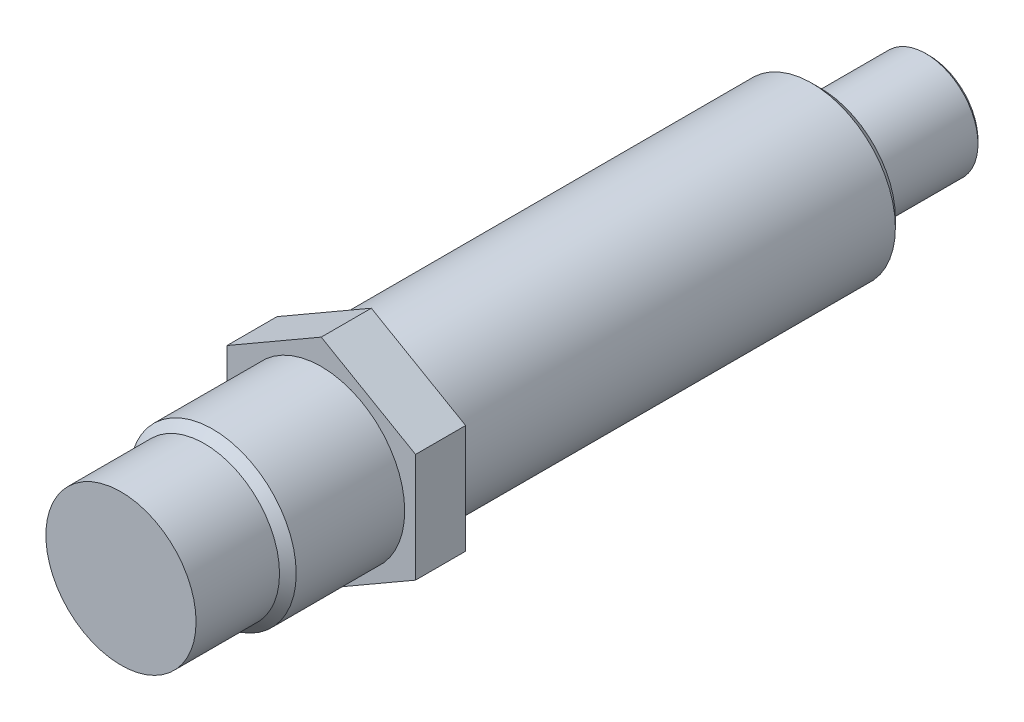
from build123d import *

# Parameters (mm, degrees)
NUT_DEPTH = 7.62


with BuildPart() as part:
    # Sketch1 → SHOCK (revolve)
    with BuildSketch(Plane(origin=(0, 0, 0), x_dir=(0, 0, -1), z_dir=(1, 0, 0)), mode=Mode.PRIVATE) as shock_sk:
        Polygon((122.9995, 0), (122.9995, 7.4295), (122.4915, 7.9375), (108.712, 7.9375), (108.712, 3.175), (106.426, 3.175), (106.426, 11.43), (105.156, 12.7), (13.97, 12.7), (12.7, 11.43), (0, 11.43), (0, 0), align=None)
    revolve(shock_sk.sketch.rotate(Axis((0, 0, 0), (0, 0, -1)), 90), axis=Axis((0, 0, 0), (0, 0, -1)))

    # Sketch4 → NUT (add)
    with BuildSketch(Plane.XY.offset(-38.1)):
        Polygon((14.351, -8.285553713), (14.351, 8.285553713), (0, 16.571107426), (-14.351, 8.285553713), (-14.351, -8.285553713), (0, -16.571107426), align=None)
    extrude(amount=NUT_DEPTH)


solid = part.part
